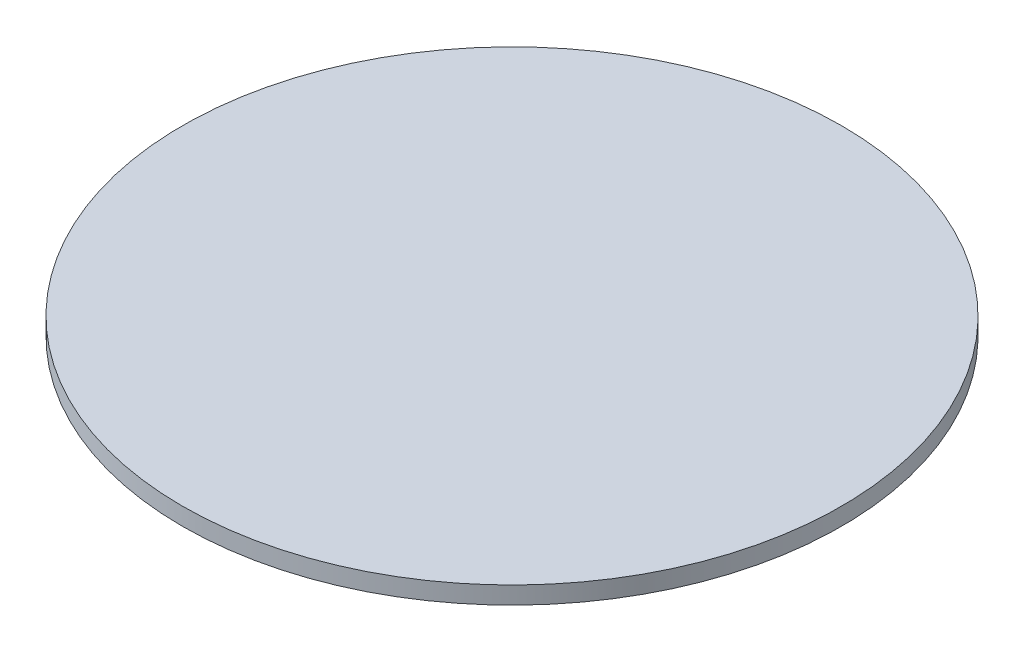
from build123d import *

# Parameters (mm, degrees)
SKETCH1_R           = 75.5
BOSS_EXTRUDE1_DEPTH = 4


with BuildPart() as part:
    # Sketch1 → Boss-Extrude1 (new body)
    with BuildSketch(Plane(origin=(0, 0, 0), x_dir=(1, 0, 0), z_dir=(0, 1, 0))):
        with Locations(Location((0, 0, 0), (0, 0, 270))):
            Circle(SKETCH1_R)
    extrude(amount=BOSS_EXTRUDE1_DEPTH)


solid = part.part
